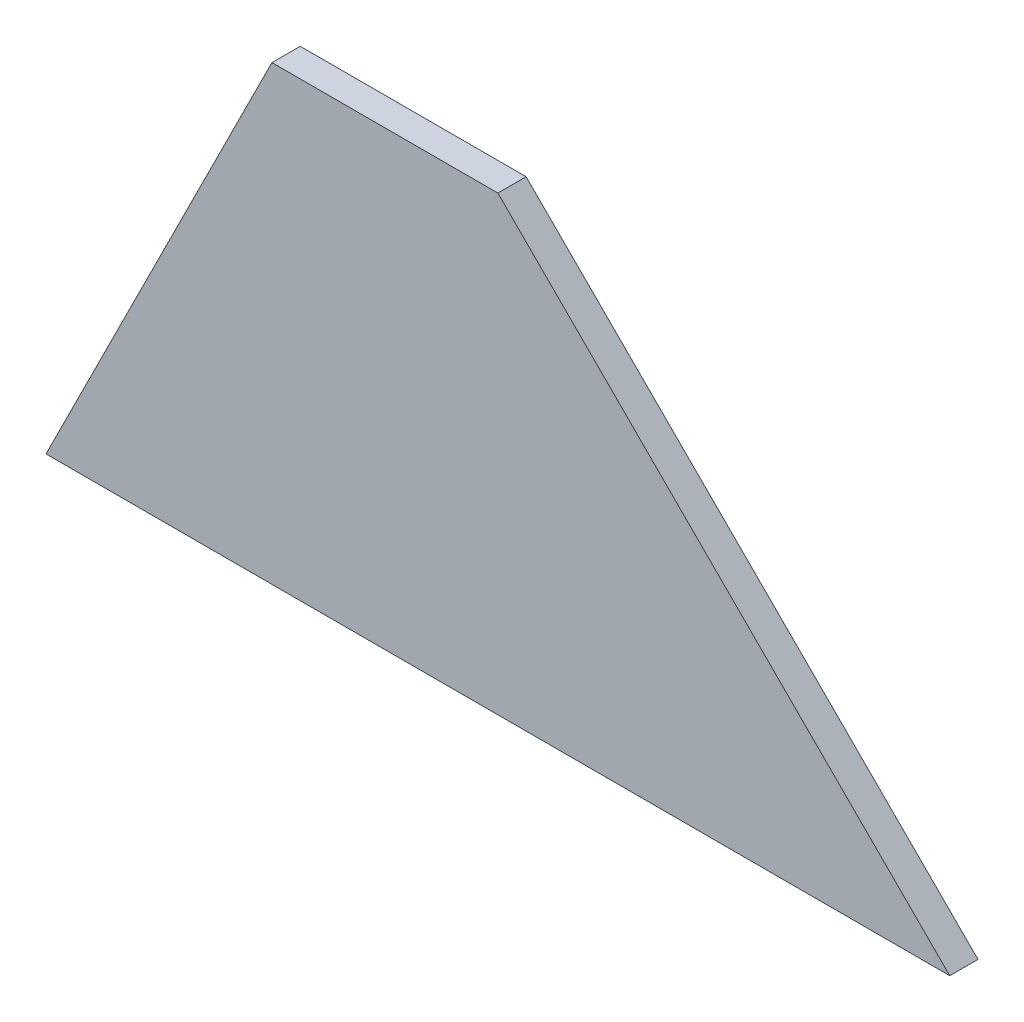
from build123d import *

# Parameters (mm, degrees)
EXTRUDE1_DEPTH = 1.058333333


with BuildPart() as part:
    # Sketch1 → Extrude1 (new body)
    with BuildSketch(Plane.XY):
        Polygon((0, 0), (-33.866666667, 0), (-25.4, 16.933333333), (-16.933333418, 16.933333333), align=None)
    extrude(amount=EXTRUDE1_DEPTH)


solid = part.part
